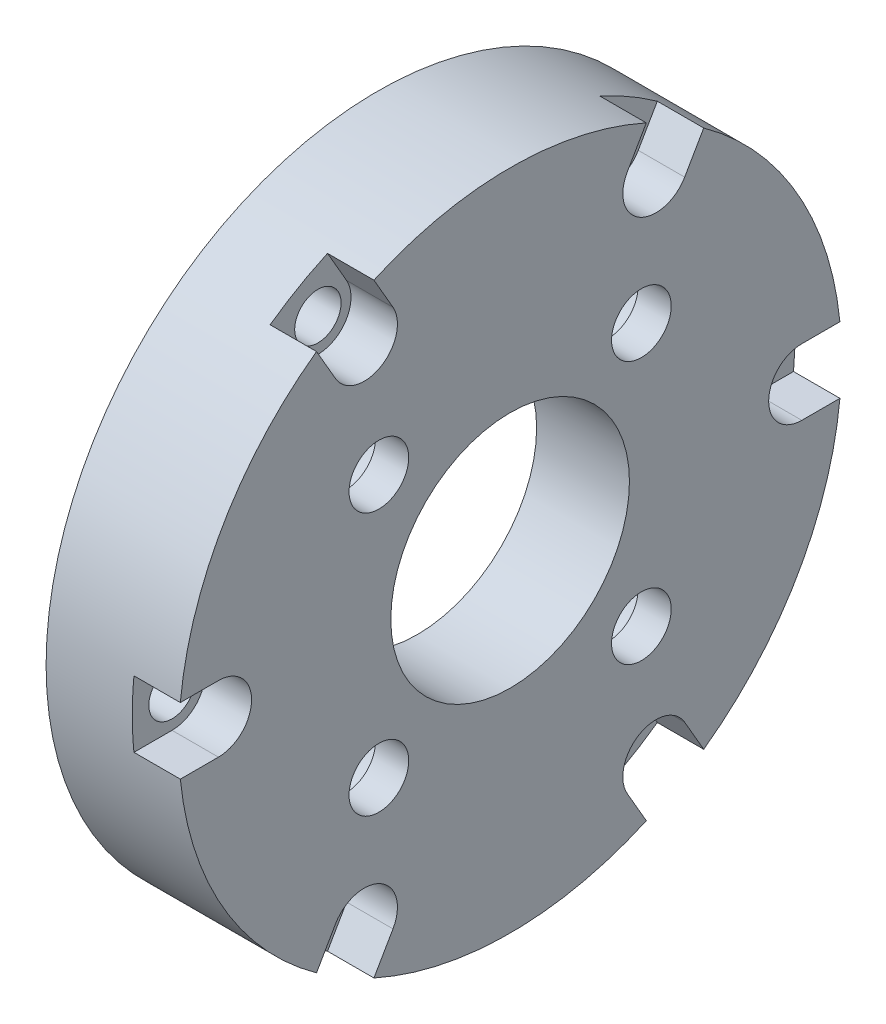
ISO-10303-21;
HEADER;
FILE_DESCRIPTION(('STEP AP214'),'2;1');
FILE_NAME('part.step','',(''),(''),'','','');
FILE_SCHEMA(('AUTOMOTIVE_DESIGN { 1 0 10303 214 1 1 1 1 }'));
ENDSEC;
DATA;
#1=APPLICATION_CONTEXT('core data for automotive mechanical design processes');
#2=APPLICATION_PROTOCOL_DEFINITION('international standard','automotive_design',2000,#1);
#3=PRODUCT_CONTEXT('',#1,'mechanical');
#4=PRODUCT('Part','Part','',(#3));
#5=PRODUCT_RELATED_PRODUCT_CATEGORY('part','',(#4));
#6=PRODUCT_DEFINITION_FORMATION('','',#4);
#7=PRODUCT_DEFINITION_CONTEXT('part definition',#1,'design');
#8=PRODUCT_DEFINITION('design','',#6,#7);
#9=PRODUCT_DEFINITION_SHAPE('','',#8);
#10=(LENGTH_UNIT() NAMED_UNIT(*) SI_UNIT(.MILLI.,.METRE.));
#11=(NAMED_UNIT(*) PLANE_ANGLE_UNIT() SI_UNIT($,.RADIAN.));
#12=(NAMED_UNIT(*) SI_UNIT($,.STERADIAN.) SOLID_ANGLE_UNIT());
#13=UNCERTAINTY_MEASURE_WITH_UNIT(LENGTH_MEASURE(1.E-05),#10,'distance_accuracy_value','');
#14=(GEOMETRIC_REPRESENTATION_CONTEXT(3) GLOBAL_UNCERTAINTY_ASSIGNED_CONTEXT((#13)) GLOBAL_UNIT_ASSIGNED_CONTEXT((#10,
#11,#12)) REPRESENTATION_CONTEXT('',''));
#15=CARTESIAN_POINT('',(0.,0.,0.));
#16=DIRECTION('',(0.,0.,1.));
#17=DIRECTION('',(1.,0.,0.));
#18=AXIS2_PLACEMENT_3D('',#15,#16,#17);
#19=CARTESIAN_POINT('',(-2.,19.,0.));
#20=DIRECTION('',(1.,0.,0.));
#21=DIRECTION('',(0.,0.,-1.));
#22=AXIS2_PLACEMENT_3D('',#19,#20,#21);
#23=PLANE('',#22);
#24=CARTESIAN_POINT('',(-2.,0.,0.));
#25=DIRECTION('',(-1.,0.,0.));
#26=DIRECTION('',(0.,0.,1.));
#27=AXIS2_PLACEMENT_3D('',#24,#25,#26);
#28=CIRCLE('',#27,19.);
#29=CARTESIAN_POINT('',(-2.,0.,19.));
#30=VERTEX_POINT('',#29);
#31=EDGE_CURVE('E359',#30,#30,#28,.T.);
#32=ORIENTED_EDGE('',*,*,#31,.T.);
#33=EDGE_LOOP('',(#32));
#34=FACE_BOUND('',#33,.T.);
#35=CARTESIAN_POINT('',(-2.,0.,0.));
#36=DIRECTION('',(-1.,0.,0.));
#37=DIRECTION('',(0.,0.,1.));
#38=AXIS2_PLACEMENT_3D('',#35,#36,#37);
#39=CIRCLE('',#38,8.99999999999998);
#40=CARTESIAN_POINT('',(-2.,0.,8.99999999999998));
#41=VERTEX_POINT('',#40);
#42=EDGE_CURVE('E356',#41,#41,#39,.T.);
#43=ORIENTED_EDGE('',*,*,#42,.F.);
#44=EDGE_LOOP('',(#43));
#45=FACE_BOUND('',#44,.T.);
#46=CARTESIAN_POINT('',(-2.,9.89949493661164,9.89949493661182));
#47=DIRECTION('',(-1.,0.,0.));
#48=DIRECTION('',(0.,0.,1.));
#49=AXIS2_PLACEMENT_3D('',#46,#47,#48);
#50=CIRCLE('',#49,3.99999999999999);
#51=CARTESIAN_POINT('',(-2.,9.89949493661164,13.8994949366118));
#52=VERTEX_POINT('',#51);
#53=EDGE_CURVE('E529',#52,#52,#50,.T.);
#54=ORIENTED_EDGE('',*,*,#53,.F.);
#55=EDGE_LOOP('',(#54));
#56=FACE_BOUND('',#55,.T.);
#57=CARTESIAN_POINT('',(-2.,-9.89949493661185,9.89949493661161));
#58=DIRECTION('',(-1.,0.,0.));
#59=DIRECTION('',(0.,0.,1.));
#60=AXIS2_PLACEMENT_3D('',#57,#58,#59);
#61=CIRCLE('',#60,3.99999999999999);
#62=CARTESIAN_POINT('',(-2.,-9.89949493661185,13.8994949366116));
#63=VERTEX_POINT('',#62);
#64=EDGE_CURVE('E541',#63,#63,#61,.T.);
#65=ORIENTED_EDGE('',*,*,#64,.F.);
#66=EDGE_LOOP('',(#65));
#67=FACE_BOUND('',#66,.T.);
#68=CARTESIAN_POINT('',(-2.,-9.89949493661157,-9.89949493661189));
#69=DIRECTION('',(-1.,0.,0.));
#70=DIRECTION('',(0.,0.,1.));
#71=AXIS2_PLACEMENT_3D('',#68,#69,#70);
#72=CIRCLE('',#71,3.99999999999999);
#73=CARTESIAN_POINT('',(-2.,-9.89949493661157,-5.89949493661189));
#74=VERTEX_POINT('',#73);
#75=EDGE_CURVE('E553',#74,#74,#72,.T.);
#76=ORIENTED_EDGE('',*,*,#75,.F.);
#77=EDGE_LOOP('',(#76));
#78=FACE_BOUND('',#77,.T.);
#79=CARTESIAN_POINT('',(-2.,9.89949493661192,-9.89949493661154));
#80=DIRECTION('',(-1.,0.,0.));
#81=DIRECTION('',(0.,0.,1.));
#82=AXIS2_PLACEMENT_3D('',#79,#80,#81);
#83=CIRCLE('',#82,3.99999999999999);
#84=CARTESIAN_POINT('',(-2.,9.89949493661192,-5.89949493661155));
#85=VERTEX_POINT('',#84);
#86=EDGE_CURVE('E565',#85,#85,#83,.T.);
#87=ORIENTED_EDGE('',*,*,#86,.F.);
#88=EDGE_LOOP('',(#87));
#89=FACE_BOUND('',#88,.T.);
#90=ADVANCED_FACE('F31',(#34,#45,#56,#67,#78,#89),#23,.F.);
#91=CARTESIAN_POINT('',(-14.9363733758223,0.,0.));
#92=DIRECTION('',(-1.,0.,0.));
#93=DIRECTION('',(0.,0.,1.));
#94=AXIS2_PLACEMENT_3D('',#91,#92,#93);
#95=CYLINDRICAL_SURFACE('',#94,25.);
#96=CARTESIAN_POINT('',(4.99999999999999,0.,0.));
#97=DIRECTION('',(-1.,0.,0.));
#98=DIRECTION('',(0.,0.,1.));
#99=AXIS2_PLACEMENT_3D('',#96,#97,#98);
#100=CIRCLE('',#99,25.);
#101=CARTESIAN_POINT('',(4.99999999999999,2.5,24.8746859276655));
#102=VERTEX_POINT('',#101);
#103=CARTESIAN_POINT('',(4.99999999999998,20.2921099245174,14.6024064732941));
#104=VERTEX_POINT('',#103);
#105=EDGE_CURVE('E350',#102,#104,#100,.T.);
#106=ORIENTED_EDGE('',*,*,#105,.T.);
#107=DIRECTION('',(-1.,0.,0.));
#108=VECTOR('',#107,1.);
#109=CARTESIAN_POINT('',(-14.9363733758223,20.2921099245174,14.6024064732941));
#110=LINE('',#109,#108);
#111=CARTESIAN_POINT('',(1.49999999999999,20.2921099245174,14.6024064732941));
#112=VERTEX_POINT('',#111);
#113=EDGE_CURVE('E198',#104,#112,#110,.T.);
#114=ORIENTED_EDGE('',*,*,#113,.T.);
#115=CARTESIAN_POINT('',(1.49999999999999,0.,0.));
#116=DIRECTION('',(1.,0.,0.));
#117=DIRECTION('',(0.,0.,-1.));
#118=AXIS2_PLACEMENT_3D('',#115,#116,#117);
#119=CIRCLE('',#118,25.);
#120=CARTESIAN_POINT('',(1.49999999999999,22.7921099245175,10.2722794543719));
#121=VERTEX_POINT('',#120);
#122=EDGE_CURVE('E11',#121,#112,#119,.T.);
#123=ORIENTED_EDGE('',*,*,#122,.F.);
#124=DIRECTION('',(-1.,0.,0.));
#125=VECTOR('',#124,1.);
#126=CARTESIAN_POINT('',(-14.9363733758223,22.7921099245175,10.2722794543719));
#127=LINE('',#126,#125);
#128=CARTESIAN_POINT('',(4.99999999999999,22.7921099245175,10.2722794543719));
#129=VERTEX_POINT('',#128);
#130=EDGE_CURVE('E206',#121,#129,#127,.F.);
#131=ORIENTED_EDGE('',*,*,#130,.T.);
#132=CARTESIAN_POINT('',(4.99999999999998,22.7921099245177,-10.2722794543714));
#133=VERTEX_POINT('',#132);
#134=EDGE_CURVE('E353',#129,#133,#100,.T.);
#135=ORIENTED_EDGE('',*,*,#134,.T.);
#136=DIRECTION('',(-1.,0.,0.));
#137=VECTOR('',#136,1.);
#138=CARTESIAN_POINT('',(-14.9363733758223,22.7921099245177,-10.2722794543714));
#139=LINE('',#138,#137);
#140=CARTESIAN_POINT('',(1.49999999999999,22.7921099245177,-10.2722794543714));
#141=VERTEX_POINT('',#140);
#142=EDGE_CURVE('E250',#133,#141,#139,.T.);
#143=ORIENTED_EDGE('',*,*,#142,.T.);
#144=CARTESIAN_POINT('',(1.49999999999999,0.,0.));
#145=DIRECTION('',(1.,0.,0.));
#146=DIRECTION('',(0.,0.,-1.));
#147=AXIS2_PLACEMENT_3D('',#144,#145,#146);
#148=CIRCLE('',#147,25.);
#149=CARTESIAN_POINT('',(1.49999999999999,20.2921099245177,-14.6024064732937));
#150=VERTEX_POINT('',#149);
#151=EDGE_CURVE('E202',#150,#141,#148,.T.);
#152=ORIENTED_EDGE('',*,*,#151,.F.);
#153=DIRECTION('',(-1.,0.,0.));
#154=VECTOR('',#153,1.);
#155=CARTESIAN_POINT('',(-14.9363733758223,20.2921099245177,-14.6024064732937));
#156=LINE('',#155,#154);
#157=CARTESIAN_POINT('',(4.99999999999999,20.2921099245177,-14.6024064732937));
#158=VERTEX_POINT('',#157);
#159=EDGE_CURVE('E246',#150,#158,#156,.F.);
#160=ORIENTED_EDGE('',*,*,#159,.T.);
#161=CARTESIAN_POINT('',(4.99999999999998,2.50000000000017,-24.8746859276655));
#162=VERTEX_POINT('',#161);
#163=EDGE_CURVE('E404',#158,#162,#100,.T.);
#164=ORIENTED_EDGE('',*,*,#163,.T.);
#165=DIRECTION('',(-1.,0.,0.));
#166=VECTOR('',#165,1.);
#167=CARTESIAN_POINT('',(-14.9363733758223,2.50000000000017,-24.8746859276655));
#168=LINE('',#167,#166);
#169=CARTESIAN_POINT('',(1.49999999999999,2.50000000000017,-24.8746859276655));
#170=VERTEX_POINT('',#169);
#171=EDGE_CURVE('E274',#162,#170,#168,.T.);
#172=ORIENTED_EDGE('',*,*,#171,.T.);
#173=CARTESIAN_POINT('',(1.49999999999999,0.,0.));
#174=DIRECTION('',(1.,0.,0.));
#175=DIRECTION('',(0.,1.,0.));
#176=AXIS2_PLACEMENT_3D('',#173,#174,#175);
#177=CIRCLE('',#176,25.);
#178=CARTESIAN_POINT('',(1.49999999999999,-2.49999999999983,-24.8746859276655));
#179=VERTEX_POINT('',#178);
#180=EDGE_CURVE('E386',#179,#170,#177,.T.);
#181=ORIENTED_EDGE('',*,*,#180,.F.);
#182=DIRECTION('',(-1.,0.,0.));
#183=VECTOR('',#182,1.);
#184=CARTESIAN_POINT('',(-14.9363733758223,-2.49999999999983,-24.8746859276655));
#185=LINE('',#184,#183);
#186=CARTESIAN_POINT('',(4.99999999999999,-2.49999999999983,-24.8746859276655));
#187=VERTEX_POINT('',#186);
#188=EDGE_CURVE('E269',#179,#187,#185,.F.);
#189=ORIENTED_EDGE('',*,*,#188,.T.);
#190=CARTESIAN_POINT('',(4.99999999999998,-20.2921099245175,-14.6024064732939));
#191=VERTEX_POINT('',#190);
#192=EDGE_CURVE('E405',#187,#191,#100,.T.);
#193=ORIENTED_EDGE('',*,*,#192,.T.);
#194=DIRECTION('',(-1.,0.,0.));
#195=VECTOR('',#194,1.);
#196=CARTESIAN_POINT('',(-14.9363733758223,-20.2921099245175,-14.6024064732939));
#197=LINE('',#196,#195);
#198=CARTESIAN_POINT('',(1.49999999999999,-20.2921099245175,-14.6024064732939));
#199=VERTEX_POINT('',#198);
#200=EDGE_CURVE('E298',#191,#199,#197,.T.);
#201=ORIENTED_EDGE('',*,*,#200,.T.);
#202=CARTESIAN_POINT('',(1.49999999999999,0.,0.));
#203=DIRECTION('',(1.,0.,0.));
#204=DIRECTION('',(0.,0.,-1.));
#205=AXIS2_PLACEMENT_3D('',#202,#203,#204);
#206=CIRCLE('',#205,25.);
#207=CARTESIAN_POINT('',(1.49999999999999,-22.7921099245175,-10.2722794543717));
#208=VERTEX_POINT('',#207);
#209=EDGE_CURVE('E381',#208,#199,#206,.T.);
#210=ORIENTED_EDGE('',*,*,#209,.F.);
#211=DIRECTION('',(-1.,0.,0.));
#212=VECTOR('',#211,1.);
#213=CARTESIAN_POINT('',(-14.9363733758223,-22.7921099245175,-10.2722794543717));
#214=LINE('',#213,#212);
#215=CARTESIAN_POINT('',(4.99999999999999,-22.7921099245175,-10.2722794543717));
#216=VERTEX_POINT('',#215);
#217=EDGE_CURVE('E293',#208,#216,#214,.F.);
#218=ORIENTED_EDGE('',*,*,#217,.T.);
#219=CARTESIAN_POINT('',(4.99999999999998,-22.7921099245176,10.2722794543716));
#220=VERTEX_POINT('',#219);
#221=EDGE_CURVE('E408',#216,#220,#100,.T.);
#222=ORIENTED_EDGE('',*,*,#221,.T.);
#223=DIRECTION('',(-1.,0.,0.));
#224=VECTOR('',#223,1.);
#225=CARTESIAN_POINT('',(-14.9363733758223,-22.7921099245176,10.2722794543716));
#226=LINE('',#225,#224);
#227=CARTESIAN_POINT('',(1.49999999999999,-22.7921099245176,10.2722794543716));
#228=VERTEX_POINT('',#227);
#229=EDGE_CURVE('E322',#220,#228,#226,.T.);
#230=ORIENTED_EDGE('',*,*,#229,.T.);
#231=CARTESIAN_POINT('',(1.49999999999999,0.,0.));
#232=DIRECTION('',(1.,0.,0.));
#233=DIRECTION('',(0.,0.,-1.));
#234=AXIS2_PLACEMENT_3D('',#231,#232,#233);
#235=CIRCLE('',#234,25.);
#236=CARTESIAN_POINT('',(1.49999999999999,-20.2921099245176,14.6024064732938));
#237=VERTEX_POINT('',#236);
#238=EDGE_CURVE('E376',#237,#228,#235,.T.);
#239=ORIENTED_EDGE('',*,*,#238,.F.);
#240=DIRECTION('',(-1.,0.,0.));
#241=VECTOR('',#240,1.);
#242=CARTESIAN_POINT('',(-14.9363733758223,-20.2921099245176,14.6024064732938));
#243=LINE('',#242,#241);
#244=CARTESIAN_POINT('',(4.99999999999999,-20.2921099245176,14.6024064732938));
#245=VERTEX_POINT('',#244);
#246=EDGE_CURVE('E317',#237,#245,#243,.F.);
#247=ORIENTED_EDGE('',*,*,#246,.T.);
#248=CARTESIAN_POINT('',(4.99999999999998,-2.5,24.8746859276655));
#249=VERTEX_POINT('',#248);
#250=EDGE_CURVE('E349',#245,#249,#100,.T.);
#251=ORIENTED_EDGE('',*,*,#250,.T.);
#252=DIRECTION('',(-1.,0.,0.));
#253=VECTOR('',#252,1.);
#254=CARTESIAN_POINT('',(-14.9363733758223,-2.49999999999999,24.8746859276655));
#255=LINE('',#254,#253);
#256=CARTESIAN_POINT('',(1.49999999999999,-2.5,24.8746859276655));
#257=VERTEX_POINT('',#256);
#258=EDGE_CURVE('E346',#249,#257,#255,.T.);
#259=ORIENTED_EDGE('',*,*,#258,.T.);
#260=CARTESIAN_POINT('',(1.49999999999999,0.,0.));
#261=DIRECTION('',(1.,0.,0.));
#262=DIRECTION('',(0.,1.,0.));
#263=AXIS2_PLACEMENT_3D('',#260,#261,#262);
#264=CIRCLE('',#263,25.);
#265=CARTESIAN_POINT('',(1.49999999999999,2.5,24.8746859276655));
#266=VERTEX_POINT('',#265);
#267=EDGE_CURVE('E371',#266,#257,#264,.T.);
#268=ORIENTED_EDGE('',*,*,#267,.F.);
#269=DIRECTION('',(-1.,0.,0.));
#270=VECTOR('',#269,1.);
#271=CARTESIAN_POINT('',(-14.9363733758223,2.50000000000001,24.8746859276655));
#272=LINE('',#271,#270);
#273=EDGE_CURVE('E341',#266,#102,#272,.F.);
#274=ORIENTED_EDGE('',*,*,#273,.T.);
#275=EDGE_LOOP('',(#106,#114,#123,#131,#135,#143,#152,#160,#164,#172,#181,#189,#193,#201,#210,
#218,#222,#230,#239,#247,#251,#259,#268,#274));
#276=FACE_BOUND('',#275,.T.);
#277=CARTESIAN_POINT('',(-5.,0.,0.));
#278=DIRECTION('',(-1.,0.,0.));
#279=DIRECTION('',(0.,0.,1.));
#280=AXIS2_PLACEMENT_3D('',#277,#278,#279);
#281=CIRCLE('',#280,25.);
#282=CARTESIAN_POINT('',(-5.,0.,25.));
#283=VERTEX_POINT('',#282);
#284=EDGE_CURVE('E365',#283,#283,#281,.T.);
#285=ORIENTED_EDGE('',*,*,#284,.F.);
#286=EDGE_LOOP('',(#285));
#287=FACE_BOUND('',#286,.T.);
#288=ADVANCED_FACE('F33',(#276,#287),#95,.T.);
#289=CARTESIAN_POINT('',(-5.,25.,0.));
#290=DIRECTION('',(1.,0.,0.));
#291=DIRECTION('',(0.,0.,-1.));
#292=AXIS2_PLACEMENT_3D('',#289,#290,#291);
#293=PLANE('',#292);
#294=CARTESIAN_POINT('',(-5.00000000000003,19.0525588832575,11.0000000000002));
#295=DIRECTION('',(1.,0.,0.));
#296=DIRECTION('',(0.,-0.866025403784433,-0.50000000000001));
#297=AXIS2_PLACEMENT_3D('',#294,#295,#296);
#298=CIRCLE('',#297,1.75);
#299=CARTESIAN_POINT('',(-5.00000000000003,17.5370144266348,10.1250000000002));
#300=VERTEX_POINT('',#299);
#301=EDGE_CURVE('E468',#300,#300,#298,.T.);
#302=ORIENTED_EDGE('',*,*,#301,.T.);
#303=EDGE_LOOP('',(#302));
#304=FACE_BOUND('',#303,.T.);
#305=CARTESIAN_POINT('',(-5.00000000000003,19.0525588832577,-10.9999999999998));
#306=DIRECTION('',(1.,0.,0.));
#307=DIRECTION('',(0.,-0.866025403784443,0.499999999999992));
#308=AXIS2_PLACEMENT_3D('',#305,#306,#307);
#309=CIRCLE('',#308,1.75);
#310=CARTESIAN_POINT('',(-5.00000000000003,17.537014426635,-10.1249999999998));
#311=VERTEX_POINT('',#310);
#312=EDGE_CURVE('E472',#311,#311,#309,.T.);
#313=ORIENTED_EDGE('',*,*,#312,.T.);
#314=EDGE_LOOP('',(#313));
#315=FACE_BOUND('',#314,.T.);
#316=CARTESIAN_POINT('',(-5.00000000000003,1.53153456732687E-13,-22.));
#317=DIRECTION('',(1.,0.,0.));
#318=DIRECTION('',(0.,0.,1.));
#319=AXIS2_PLACEMENT_3D('',#316,#317,#318);
#320=CIRCLE('',#319,1.75);
#321=CARTESIAN_POINT('',(-5.00000000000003,1.40933264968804E-13,-20.25));
#322=VERTEX_POINT('',#321);
#323=EDGE_CURVE('E476',#322,#322,#320,.T.);
#324=ORIENTED_EDGE('',*,*,#323,.T.);
#325=EDGE_LOOP('',(#324));
#326=FACE_BOUND('',#325,.T.);
#327=CARTESIAN_POINT('',(-5.00000000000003,-19.0525588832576,-11.0000000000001));
#328=DIRECTION('',(1.,0.,0.));
#329=DIRECTION('',(0.,0.866025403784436,0.500000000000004));
#330=AXIS2_PLACEMENT_3D('',#327,#328,#329);
#331=CIRCLE('',#330,1.75);
#332=CARTESIAN_POINT('',(-5.00000000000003,-17.5370144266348,-10.1250000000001));
#333=VERTEX_POINT('',#332);
#334=EDGE_CURVE('E480',#333,#333,#331,.T.);
#335=ORIENTED_EDGE('',*,*,#334,.T.);
#336=EDGE_LOOP('',(#335));
#337=FACE_BOUND('',#336,.T.);
#338=CARTESIAN_POINT('',(-5.00000000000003,-19.0525588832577,11.));
#339=DIRECTION('',(1.,0.,0.));
#340=DIRECTION('',(0.,0.86602540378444,-0.499999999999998));
#341=AXIS2_PLACEMENT_3D('',#338,#339,#340);
#342=CIRCLE('',#341,1.75);
#343=CARTESIAN_POINT('',(-5.00000000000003,-17.5370144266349,10.125));
#344=VERTEX_POINT('',#343);
#345=EDGE_CURVE('E484',#344,#344,#342,.T.);
#346=ORIENTED_EDGE('',*,*,#345,.T.);
#347=EDGE_LOOP('',(#346));
#348=FACE_BOUND('',#347,.T.);
#349=CARTESIAN_POINT('',(-5.00000000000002,0.,22.));
#350=DIRECTION('',(1.,0.,0.));
#351=DIRECTION('',(0.,0.,-1.));
#352=AXIS2_PLACEMENT_3D('',#349,#350,#351);
#353=CIRCLE('',#352,1.75);
#354=CARTESIAN_POINT('',(-5.00000000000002,0.,20.25));
#355=VERTEX_POINT('',#354);
#356=EDGE_CURVE('E214',#355,#355,#353,.T.);
#357=ORIENTED_EDGE('',*,*,#356,.T.);
#358=EDGE_LOOP('',(#357));
#359=FACE_BOUND('',#358,.T.);
#360=CARTESIAN_POINT('',(-5.,0.,0.));
#361=DIRECTION('',(-1.,0.,0.));
#362=DIRECTION('',(0.,0.,1.));
#363=AXIS2_PLACEMENT_3D('',#360,#361,#362);
#364=CIRCLE('',#363,19.);
#365=CARTESIAN_POINT('',(-5.,0.,19.));
#366=VERTEX_POINT('',#365);
#367=EDGE_CURVE('E362',#366,#366,#364,.T.);
#368=ORIENTED_EDGE('',*,*,#367,.F.);
#369=EDGE_LOOP('',(#368));
#370=FACE_BOUND('',#369,.T.);
#371=ORIENTED_EDGE('',*,*,#284,.T.);
#372=EDGE_LOOP('',(#371));
#373=FACE_BOUND('',#372,.T.);
#374=ADVANCED_FACE('F452',(#304,#315,#326,#337,#348,#359,#370,#373),#293,.F.);
#375=CARTESIAN_POINT('',(-14.9363733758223,0.,0.));
#376=DIRECTION('',(-1.,0.,0.));
#377=DIRECTION('',(0.,0.,1.));
#378=AXIS2_PLACEMENT_3D('',#375,#376,#377);
#379=CYLINDRICAL_SURFACE('',#378,19.);
#380=ORIENTED_EDGE('',*,*,#31,.F.);
#381=EDGE_LOOP('',(#380));
#382=FACE_BOUND('',#381,.T.);
#383=ORIENTED_EDGE('',*,*,#367,.T.);
#384=EDGE_LOOP('',(#383));
#385=FACE_BOUND('',#384,.T.);
#386=ADVANCED_FACE('F458',(#382,#385),#379,.F.);
#387=CARTESIAN_POINT('',(-14.9363733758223,0.,0.));
#388=DIRECTION('',(-1.,0.,0.));
#389=DIRECTION('',(0.,0.,1.));
#390=AXIS2_PLACEMENT_3D('',#387,#388,#389);
#391=CYLINDRICAL_SURFACE('',#390,8.99999999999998);
#392=CARTESIAN_POINT('',(4.99999999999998,0.,0.));
#393=DIRECTION('',(-1.,0.,0.));
#394=DIRECTION('',(0.,0.,1.));
#395=AXIS2_PLACEMENT_3D('',#392,#393,#394);
#396=CIRCLE('',#395,8.99999999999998);
#397=CARTESIAN_POINT('',(4.99999999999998,0.,8.99999999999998));
#398=VERTEX_POINT('',#397);
#399=EDGE_CURVE('E352',#398,#398,#396,.T.);
#400=ORIENTED_EDGE('',*,*,#399,.F.);
#401=EDGE_LOOP('',(#400));
#402=FACE_BOUND('',#401,.T.);
#403=ORIENTED_EDGE('',*,*,#42,.T.);
#404=EDGE_LOOP('',(#403));
#405=FACE_BOUND('',#404,.T.);
#406=ADVANCED_FACE('F456',(#402,#405),#391,.F.);
#407=CARTESIAN_POINT('',(4.99999999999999,9.,0.));
#408=DIRECTION('',(-1.,0.,0.));
#409=DIRECTION('',(0.,0.,1.));
#410=AXIS2_PLACEMENT_3D('',#407,#408,#409);
#411=PLANE('',#410);
#412=CARTESIAN_POINT('',(4.99999999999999,9.89949493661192,-9.89949493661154));
#413=DIRECTION('',(-1.,0.,0.));
#414=DIRECTION('',(0.,0.,1.));
#415=AXIS2_PLACEMENT_3D('',#412,#413,#414);
#416=CIRCLE('',#415,2.25);
#417=CARTESIAN_POINT('',(4.99999999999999,9.89949493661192,-7.64949493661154));
#418=VERTEX_POINT('',#417);
#419=EDGE_CURVE('E556',#418,#418,#416,.T.);
#420=ORIENTED_EDGE('',*,*,#419,.T.);
#421=EDGE_LOOP('',(#420));
#422=FACE_BOUND('',#421,.T.);
#423=CARTESIAN_POINT('',(4.99999999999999,-9.89949493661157,-9.89949493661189));
#424=DIRECTION('',(-1.,0.,0.));
#425=DIRECTION('',(0.,0.,1.));
#426=AXIS2_PLACEMENT_3D('',#423,#424,#425);
#427=CIRCLE('',#426,2.25);
#428=CARTESIAN_POINT('',(4.99999999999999,-9.89949493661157,-7.64949493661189));
#429=VERTEX_POINT('',#428);
#430=EDGE_CURVE('E544',#429,#429,#427,.T.);
#431=ORIENTED_EDGE('',*,*,#430,.T.);
#432=EDGE_LOOP('',(#431));
#433=FACE_BOUND('',#432,.T.);
#434=CARTESIAN_POINT('',(4.99999999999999,-9.89949493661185,9.89949493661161));
#435=DIRECTION('',(-1.,0.,0.));
#436=DIRECTION('',(0.,0.,1.));
#437=AXIS2_PLACEMENT_3D('',#434,#435,#436);
#438=CIRCLE('',#437,2.25);
#439=CARTESIAN_POINT('',(4.99999999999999,-9.89949493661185,12.1494949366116));
#440=VERTEX_POINT('',#439);
#441=EDGE_CURVE('E532',#440,#440,#438,.T.);
#442=ORIENTED_EDGE('',*,*,#441,.T.);
#443=EDGE_LOOP('',(#442));
#444=FACE_BOUND('',#443,.T.);
#445=CARTESIAN_POINT('',(4.99999999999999,9.89949493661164,9.89949493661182));
#446=DIRECTION('',(-1.,0.,0.));
#447=DIRECTION('',(0.,0.,1.));
#448=AXIS2_PLACEMENT_3D('',#445,#446,#447);
#449=CIRCLE('',#448,2.25);
#450=CARTESIAN_POINT('',(4.99999999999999,9.89949493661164,12.1494949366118));
#451=VERTEX_POINT('',#450);
#452=EDGE_CURVE('E520',#451,#451,#449,.T.);
#453=ORIENTED_EDGE('',*,*,#452,.T.);
#454=EDGE_LOOP('',(#453));
#455=FACE_BOUND('',#454,.T.);
#456=CARTESIAN_POINT('',(4.99999999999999,19.0525588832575,11.0000000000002));
#457=DIRECTION('',(1.,0.,0.));
#458=DIRECTION('',(0.,0.50000000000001,-0.866025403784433));
#459=AXIS2_PLACEMENT_3D('',#456,#457,#458);
#460=CIRCLE('',#459,2.5);
#461=CARTESIAN_POINT('',(4.99999999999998,17.8025588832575,13.1650635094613));
#462=VERTEX_POINT('',#461);
#463=CARTESIAN_POINT('',(4.99999999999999,20.3025588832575,8.83493649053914));
#464=VERTEX_POINT('',#463);
#465=EDGE_CURVE('E46',#462,#464,#460,.T.);
#466=ORIENTED_EDGE('',*,*,#465,.F.);
#467=DIRECTION('',(0.,0.866025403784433,0.50000000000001));
#468=VECTOR('',#467,1.);
#469=CARTESIAN_POINT('',(4.99999999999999,5.49999999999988,6.0621778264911));
#470=LINE('',#469,#468);
#471=EDGE_CURVE('E39',#462,#104,#470,.T.);
#472=ORIENTED_EDGE('',*,*,#471,.T.);
#473=ORIENTED_EDGE('',*,*,#105,.F.);
#474=DIRECTION('',(0.,0.,1.));
#475=VECTOR('',#474,1.);
#476=CARTESIAN_POINT('',(4.99999999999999,2.5,22.));
#477=LINE('',#476,#475);
#478=CARTESIAN_POINT('',(4.99999999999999,2.5,22.));
#479=VERTEX_POINT('',#478);
#480=EDGE_CURVE('E327',#479,#102,#477,.T.);
#481=ORIENTED_EDGE('',*,*,#480,.F.);
#482=CARTESIAN_POINT('',(4.99999999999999,0.,22.));
#483=DIRECTION('',(1.,0.,0.));
#484=DIRECTION('',(0.,1.,0.));
#485=AXIS2_PLACEMENT_3D('',#482,#483,#484);
#486=CIRCLE('',#485,2.5);
#487=CARTESIAN_POINT('',(4.99999999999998,-2.5,22.));
#488=VERTEX_POINT('',#487);
#489=EDGE_CURVE('E325',#488,#479,#486,.T.);
#490=ORIENTED_EDGE('',*,*,#489,.F.);
#491=DIRECTION('',(0.,0.,1.));
#492=VECTOR('',#491,1.);
#493=CARTESIAN_POINT('',(4.99999999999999,-2.49999999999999,0.));
#494=LINE('',#493,#492);
#495=EDGE_CURVE('E368',#488,#249,#494,.T.);
#496=ORIENTED_EDGE('',*,*,#495,.T.);
#497=ORIENTED_EDGE('',*,*,#250,.F.);
#498=DIRECTION('',(0.,-0.86602540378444,0.499999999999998));
#499=VECTOR('',#498,1.);
#500=CARTESIAN_POINT('',(4.99999999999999,-17.8025588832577,13.1650635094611));
#501=LINE('',#500,#499);
#502=CARTESIAN_POINT('',(4.99999999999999,-17.8025588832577,13.1650635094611));
#503=VERTEX_POINT('',#502);
#504=EDGE_CURVE('E303',#503,#245,#501,.T.);
#505=ORIENTED_EDGE('',*,*,#504,.F.);
#506=CARTESIAN_POINT('',(4.99999999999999,-19.0525588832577,11.));
#507=DIRECTION('',(1.,0.,0.));
#508=DIRECTION('',(0.,0.499999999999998,0.86602540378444));
#509=AXIS2_PLACEMENT_3D('',#506,#507,#508);
#510=CIRCLE('',#509,2.5);
#511=CARTESIAN_POINT('',(4.99999999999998,-20.3025588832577,8.83493649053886));
#512=VERTEX_POINT('',#511);
#513=EDGE_CURVE('E301',#512,#503,#510,.T.);
#514=ORIENTED_EDGE('',*,*,#513,.F.);
#515=DIRECTION('',(0.,-0.86602540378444,0.499999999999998));
#516=VECTOR('',#515,1.);
#517=CARTESIAN_POINT('',(4.99999999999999,5.50000000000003,-6.06217782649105));
#518=LINE('',#517,#516);
#519=EDGE_CURVE('E373',#512,#220,#518,.T.);
#520=ORIENTED_EDGE('',*,*,#519,.T.);
#521=ORIENTED_EDGE('',*,*,#221,.F.);
#522=DIRECTION('',(0.,-0.866025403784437,-0.500000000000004));
#523=VECTOR('',#522,1.);
#524=CARTESIAN_POINT('',(4.99999999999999,-20.3025588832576,-8.834936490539));
#525=LINE('',#524,#523);
#526=CARTESIAN_POINT('',(4.99999999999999,-20.3025588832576,-8.834936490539));
#527=VERTEX_POINT('',#526);
#528=EDGE_CURVE('E279',#527,#216,#525,.T.);
#529=ORIENTED_EDGE('',*,*,#528,.F.);
#530=CARTESIAN_POINT('',(4.99999999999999,-19.0525588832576,-11.0000000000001));
#531=DIRECTION('',(1.,0.,0.));
#532=DIRECTION('',(0.,-0.500000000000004,0.866025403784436));
#533=AXIS2_PLACEMENT_3D('',#530,#531,#532);
#534=CIRCLE('',#533,2.5);
#535=CARTESIAN_POINT('',(4.99999999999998,-17.8025588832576,-13.1650635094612));
#536=VERTEX_POINT('',#535);
#537=EDGE_CURVE('E277',#536,#527,#534,.T.);
#538=ORIENTED_EDGE('',*,*,#537,.F.);
#539=DIRECTION('',(0.,-0.866025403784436,-0.500000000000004));
#540=VECTOR('',#539,1.);
#541=CARTESIAN_POINT('',(4.99999999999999,7.99999999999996,1.73205080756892));
#542=LINE('',#541,#540);
#543=EDGE_CURVE('E378',#536,#191,#542,.T.);
#544=ORIENTED_EDGE('',*,*,#543,.T.);
#545=ORIENTED_EDGE('',*,*,#192,.F.);
#546=DIRECTION('',(0.,0.,-1.));
#547=VECTOR('',#546,1.);
#548=CARTESIAN_POINT('',(4.99999999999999,-2.49999999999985,-22.));
#549=LINE('',#548,#547);
#550=CARTESIAN_POINT('',(4.99999999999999,-2.49999999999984,-22.));
#551=VERTEX_POINT('',#550);
#552=EDGE_CURVE('E255',#551,#187,#549,.T.);
#553=ORIENTED_EDGE('',*,*,#552,.F.);
#554=CARTESIAN_POINT('',(4.99999999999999,1.53625267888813E-13,-22.));
#555=DIRECTION('',(1.,0.,0.));
#556=DIRECTION('',(0.,-1.,0.));
#557=AXIS2_PLACEMENT_3D('',#554,#555,#556);
#558=CIRCLE('',#557,2.5);
#559=CARTESIAN_POINT('',(4.99999999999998,2.50000000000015,-22.));
#560=VERTEX_POINT('',#559);
#561=EDGE_CURVE('E253',#560,#551,#558,.T.);
#562=ORIENTED_EDGE('',*,*,#561,.F.);
#563=DIRECTION('',(0.,0.,-1.));
#564=VECTOR('',#563,1.);
#565=CARTESIAN_POINT('',(4.99999999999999,2.49999999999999,0.));
#566=LINE('',#565,#564);
#567=EDGE_CURVE('E383',#560,#162,#566,.T.);
#568=ORIENTED_EDGE('',*,*,#567,.T.);
#569=ORIENTED_EDGE('',*,*,#163,.F.);
#570=DIRECTION('',(0.,0.866025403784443,-0.499999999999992));
#571=VECTOR('',#570,1.);
#572=CARTESIAN_POINT('',(4.99999999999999,17.8025588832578,-13.1650635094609));
#573=LINE('',#572,#571);
#574=CARTESIAN_POINT('',(4.99999999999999,17.8025588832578,-13.1650635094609));
#575=VERTEX_POINT('',#574);
#576=EDGE_CURVE('E233',#575,#158,#573,.T.);
#577=ORIENTED_EDGE('',*,*,#576,.F.);
#578=CARTESIAN_POINT('',(4.99999999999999,19.0525588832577,-10.9999999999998));
#579=DIRECTION('',(1.,0.,0.));
#580=DIRECTION('',(0.,-0.499999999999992,-0.866025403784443));
#581=AXIS2_PLACEMENT_3D('',#578,#579,#580);
#582=CIRCLE('',#581,2.5);
#583=CARTESIAN_POINT('',(4.99999999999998,20.3025588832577,-8.83493649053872));
#584=VERTEX_POINT('',#583);
#585=EDGE_CURVE('E54',#584,#575,#582,.T.);
#586=ORIENTED_EDGE('',*,*,#585,.F.);
#587=DIRECTION('',(0.,0.866025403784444,-0.499999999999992));
#588=VECTOR('',#587,1.);
#589=CARTESIAN_POINT('',(4.99999999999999,8.00000000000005,-1.73205080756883));
#590=LINE('',#589,#588);
#591=EDGE_CURVE('E388',#584,#133,#590,.T.);
#592=ORIENTED_EDGE('',*,*,#591,.T.);
#593=ORIENTED_EDGE('',*,*,#134,.F.);
#594=DIRECTION('',(0.,0.866025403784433,0.50000000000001));
#595=VECTOR('',#594,1.);
#596=CARTESIAN_POINT('',(4.99999999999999,20.3025588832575,8.83493649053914));
#597=LINE('',#596,#595);
#598=EDGE_CURVE('E213',#464,#129,#597,.T.);
#599=ORIENTED_EDGE('',*,*,#598,.F.);
#600=EDGE_LOOP('',(#466,#472,#473,#481,#490,#496,#497,#505,#514,#520,#521,#529,#538,#544,#545,
#553,#562,#568,#569,#577,#586,#592,#593,#599));
#601=FACE_BOUND('',#600,.T.);
#602=ORIENTED_EDGE('',*,*,#399,.T.);
#603=EDGE_LOOP('',(#602));
#604=FACE_BOUND('',#603,.T.);
#605=ADVANCED_FACE('F210',(#422,#433,#444,#455,#601,#604),#411,.F.);
#606=CARTESIAN_POINT('',(1.49999999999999,0.,22.));
#607=DIRECTION('',(1.,0.,0.));
#608=DIRECTION('',(0.,1.,0.));
#609=AXIS2_PLACEMENT_3D('',#606,#607,#608);
#610=PLANE('',#609);
#611=CARTESIAN_POINT('',(1.49999999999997,0.,22.));
#612=DIRECTION('',(1.,0.,0.));
#613=DIRECTION('',(0.,0.,-1.));
#614=AXIS2_PLACEMENT_3D('',#611,#612,#613);
#615=CIRCLE('',#614,1.75);
#616=CARTESIAN_POINT('',(1.49999999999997,0.,20.25));
#617=VERTEX_POINT('',#616);
#618=EDGE_CURVE('E218',#617,#617,#615,.T.);
#619=ORIENTED_EDGE('',*,*,#618,.F.);
#620=EDGE_LOOP('',(#619));
#621=FACE_BOUND('',#620,.T.);
#622=ORIENTED_EDGE('',*,*,#267,.T.);
#623=DIRECTION('',(0.,0.,-1.));
#624=VECTOR('',#623,1.);
#625=CARTESIAN_POINT('',(1.49999999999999,-2.5,22.));
#626=LINE('',#625,#624);
#627=CARTESIAN_POINT('',(1.49999999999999,-2.5,22.));
#628=VERTEX_POINT('',#627);
#629=EDGE_CURVE('E335',#257,#628,#626,.T.);
#630=ORIENTED_EDGE('',*,*,#629,.T.);
#631=CARTESIAN_POINT('',(1.49999999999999,0.,22.));
#632=DIRECTION('',(1.,0.,0.));
#633=DIRECTION('',(0.,1.,0.));
#634=AXIS2_PLACEMENT_3D('',#631,#632,#633);
#635=CIRCLE('',#634,2.5);
#636=CARTESIAN_POINT('',(1.49999999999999,2.5,22.));
#637=VERTEX_POINT('',#636);
#638=EDGE_CURVE('E329',#628,#637,#635,.T.);
#639=ORIENTED_EDGE('',*,*,#638,.T.);
#640=DIRECTION('',(0.,0.,1.));
#641=VECTOR('',#640,1.);
#642=CARTESIAN_POINT('',(1.49999999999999,2.5,22.));
#643=LINE('',#642,#641);
#644=EDGE_CURVE('E332',#637,#266,#643,.T.);
#645=ORIENTED_EDGE('',*,*,#644,.T.);
#646=EDGE_LOOP('',(#622,#630,#639,#645));
#647=FACE_BOUND('',#646,.T.);
#648=ADVANCED_FACE('F431',(#621,#647),#610,.T.);
#649=CARTESIAN_POINT('',(1.49999999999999,-2.5,22.));
#650=DIRECTION('',(0.,-1.,0.));
#651=DIRECTION('',(0.,0.,-1.));
#652=AXIS2_PLACEMENT_3D('',#649,#650,#651);
#653=PLANE('',#652);
#654=ORIENTED_EDGE('',*,*,#495,.F.);
#655=DIRECTION('',(1.,0.,0.));
#656=VECTOR('',#655,1.);
#657=CARTESIAN_POINT('',(1.49999999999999,-2.5,22.));
#658=LINE('',#657,#656);
#659=EDGE_CURVE('E338',#628,#488,#658,.T.);
#660=ORIENTED_EDGE('',*,*,#659,.F.);
#661=ORIENTED_EDGE('',*,*,#629,.F.);
#662=ORIENTED_EDGE('',*,*,#258,.F.);
#663=EDGE_LOOP('',(#654,#660,#661,#662));
#664=FACE_BOUND('',#663,.T.);
#665=ADVANCED_FACE('F420',(#664),#653,.F.);
#666=CARTESIAN_POINT('',(1.49999999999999,2.5,22.));
#667=DIRECTION('',(0.,1.,0.));
#668=DIRECTION('',(-1.,0.,0.));
#669=AXIS2_PLACEMENT_3D('',#666,#667,#668);
#670=PLANE('',#669);
#671=ORIENTED_EDGE('',*,*,#644,.F.);
#672=DIRECTION('',(1.,0.,0.));
#673=VECTOR('',#672,1.);
#674=CARTESIAN_POINT('',(1.49999999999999,2.5,22.));
#675=LINE('',#674,#673);
#676=EDGE_CURVE('E337',#637,#479,#675,.T.);
#677=ORIENTED_EDGE('',*,*,#676,.T.);
#678=ORIENTED_EDGE('',*,*,#480,.T.);
#679=ORIENTED_EDGE('',*,*,#273,.F.);
#680=EDGE_LOOP('',(#671,#677,#678,#679));
#681=FACE_BOUND('',#680,.T.);
#682=ADVANCED_FACE('F429',(#681),#670,.F.);
#683=CARTESIAN_POINT('',(1.49999999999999,0.,22.));
#684=DIRECTION('',(1.,0.,0.));
#685=DIRECTION('',(0.,1.,0.));
#686=AXIS2_PLACEMENT_3D('',#683,#684,#685);
#687=CYLINDRICAL_SURFACE('',#686,2.5);
#688=ORIENTED_EDGE('',*,*,#489,.T.);
#689=ORIENTED_EDGE('',*,*,#676,.F.);
#690=ORIENTED_EDGE('',*,*,#638,.F.);
#691=ORIENTED_EDGE('',*,*,#659,.T.);
#692=EDGE_LOOP('',(#688,#689,#690,#691));
#693=FACE_BOUND('',#692,.T.);
#694=ADVANCED_FACE('F425',(#693),#687,.F.);
#695=CARTESIAN_POINT('',(1.49999999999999,-19.0525588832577,11.));
#696=DIRECTION('',(1.,0.,0.));
#697=DIRECTION('',(0.,0.499999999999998,0.86602540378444));
#698=AXIS2_PLACEMENT_3D('',#695,#696,#697);
#699=PLANE('',#698);
#700=CARTESIAN_POINT('',(1.49999999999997,-19.0525588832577,11.));
#701=DIRECTION('',(1.,0.,0.));
#702=DIRECTION('',(0.,0.86602540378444,-0.499999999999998));
#703=AXIS2_PLACEMENT_3D('',#700,#701,#702);
#704=CIRCLE('',#703,1.75);
#705=CARTESIAN_POINT('',(1.49999999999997,-17.5370144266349,10.125));
#706=VERTEX_POINT('',#705);
#707=EDGE_CURVE('E499',#706,#706,#704,.T.);
#708=ORIENTED_EDGE('',*,*,#707,.F.);
#709=EDGE_LOOP('',(#708));
#710=FACE_BOUND('',#709,.T.);
#711=ORIENTED_EDGE('',*,*,#238,.T.);
#712=DIRECTION('',(0.,0.86602540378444,-0.499999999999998));
#713=VECTOR('',#712,1.);
#714=CARTESIAN_POINT('',(1.49999999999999,-20.3025588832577,8.83493649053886));
#715=LINE('',#714,#713);
#716=CARTESIAN_POINT('',(1.49999999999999,-20.3025588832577,8.83493649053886));
#717=VERTEX_POINT('',#716);
#718=EDGE_CURVE('E311',#228,#717,#715,.T.);
#719=ORIENTED_EDGE('',*,*,#718,.T.);
#720=CARTESIAN_POINT('',(1.49999999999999,-19.0525588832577,11.));
#721=DIRECTION('',(1.,0.,0.));
#722=DIRECTION('',(0.,0.499999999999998,0.86602540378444));
#723=AXIS2_PLACEMENT_3D('',#720,#721,#722);
#724=CIRCLE('',#723,2.5);
#725=CARTESIAN_POINT('',(1.49999999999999,-17.8025588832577,13.1650635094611));
#726=VERTEX_POINT('',#725);
#727=EDGE_CURVE('E305',#717,#726,#724,.T.);
#728=ORIENTED_EDGE('',*,*,#727,.T.);
#729=DIRECTION('',(0.,-0.86602540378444,0.499999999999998));
#730=VECTOR('',#729,1.);
#731=CARTESIAN_POINT('',(1.49999999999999,-17.8025588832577,13.1650635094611));
#732=LINE('',#731,#730);
#733=EDGE_CURVE('E308',#726,#237,#732,.T.);
#734=ORIENTED_EDGE('',*,*,#733,.T.);
#735=EDGE_LOOP('',(#711,#719,#728,#734));
#736=FACE_BOUND('',#735,.T.);
#737=ADVANCED_FACE('F691',(#710,#736),#699,.T.);
#738=CARTESIAN_POINT('',(1.49999999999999,-20.3025588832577,8.83493649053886));
#739=DIRECTION('',(0.,-0.499999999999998,-0.86602540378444));
#740=DIRECTION('',(0.,0.86602540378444,-0.499999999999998));
#741=AXIS2_PLACEMENT_3D('',#738,#739,#740);
#742=PLANE('',#741);
#743=ORIENTED_EDGE('',*,*,#519,.F.);
#744=DIRECTION('',(1.,0.,0.));
#745=VECTOR('',#744,1.);
#746=CARTESIAN_POINT('',(1.49999999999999,-20.3025588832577,8.83493649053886));
#747=LINE('',#746,#745);
#748=EDGE_CURVE('E314',#717,#512,#747,.T.);
#749=ORIENTED_EDGE('',*,*,#748,.F.);
#750=ORIENTED_EDGE('',*,*,#718,.F.);
#751=ORIENTED_EDGE('',*,*,#229,.F.);
#752=EDGE_LOOP('',(#743,#749,#750,#751));
#753=FACE_BOUND('',#752,.T.);
#754=ADVANCED_FACE('F694',(#753),#742,.F.);
#755=CARTESIAN_POINT('',(1.49999999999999,-17.8025588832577,13.1650635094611));
#756=DIRECTION('',(0.,0.499999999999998,0.86602540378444));
#757=DIRECTION('',(0.,-0.86602540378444,0.499999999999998));
#758=AXIS2_PLACEMENT_3D('',#755,#756,#757);
#759=PLANE('',#758);
#760=ORIENTED_EDGE('',*,*,#733,.F.);
#761=DIRECTION('',(1.,0.,0.));
#762=VECTOR('',#761,1.);
#763=CARTESIAN_POINT('',(1.49999999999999,-17.8025588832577,13.1650635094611));
#764=LINE('',#763,#762);
#765=EDGE_CURVE('E313',#726,#503,#764,.T.);
#766=ORIENTED_EDGE('',*,*,#765,.T.);
#767=ORIENTED_EDGE('',*,*,#504,.T.);
#768=ORIENTED_EDGE('',*,*,#246,.F.);
#769=EDGE_LOOP('',(#760,#766,#767,#768));
#770=FACE_BOUND('',#769,.T.);
#771=ADVANCED_FACE('F698',(#770),#759,.F.);
#772=CARTESIAN_POINT('',(1.49999999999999,-19.0525588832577,11.));
#773=DIRECTION('',(1.,0.,0.));
#774=DIRECTION('',(0.,0.,-1.));
#775=AXIS2_PLACEMENT_3D('',#772,#773,#774);
#776=CYLINDRICAL_SURFACE('',#775,2.5);
#777=ORIENTED_EDGE('',*,*,#513,.T.);
#778=ORIENTED_EDGE('',*,*,#765,.F.);
#779=ORIENTED_EDGE('',*,*,#727,.F.);
#780=ORIENTED_EDGE('',*,*,#748,.T.);
#781=EDGE_LOOP('',(#777,#778,#779,#780));
#782=FACE_BOUND('',#781,.T.);
#783=ADVANCED_FACE('F679',(#782),#776,.F.);
#784=CARTESIAN_POINT('',(1.49999999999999,-19.0525588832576,-11.0000000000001));
#785=DIRECTION('',(1.,0.,0.));
#786=DIRECTION('',(0.,-0.500000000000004,0.866025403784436));
#787=AXIS2_PLACEMENT_3D('',#784,#785,#786);
#788=PLANE('',#787);
#789=CARTESIAN_POINT('',(1.49999999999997,-19.0525588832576,-11.0000000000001));
#790=DIRECTION('',(1.,0.,0.));
#791=DIRECTION('',(0.,0.866025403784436,0.500000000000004));
#792=AXIS2_PLACEMENT_3D('',#789,#790,#791);
#793=CIRCLE('',#792,1.75);
#794=CARTESIAN_POINT('',(1.49999999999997,-17.5370144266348,-10.1250000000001));
#795=VERTEX_POINT('',#794);
#796=EDGE_CURVE('E505',#795,#795,#793,.T.);
#797=ORIENTED_EDGE('',*,*,#796,.F.);
#798=EDGE_LOOP('',(#797));
#799=FACE_BOUND('',#798,.T.);
#800=ORIENTED_EDGE('',*,*,#209,.T.);
#801=DIRECTION('',(0.,0.866025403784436,0.500000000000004));
#802=VECTOR('',#801,1.);
#803=CARTESIAN_POINT('',(1.49999999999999,-17.8025588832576,-13.1650635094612));
#804=LINE('',#803,#802);
#805=CARTESIAN_POINT('',(1.49999999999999,-17.8025588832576,-13.1650635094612));
#806=VERTEX_POINT('',#805);
#807=EDGE_CURVE('E287',#199,#806,#804,.T.);
#808=ORIENTED_EDGE('',*,*,#807,.T.);
#809=CARTESIAN_POINT('',(1.49999999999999,-19.0525588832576,-11.0000000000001));
#810=DIRECTION('',(1.,0.,0.));
#811=DIRECTION('',(0.,-0.500000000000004,0.866025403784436));
#812=AXIS2_PLACEMENT_3D('',#809,#810,#811);
#813=CIRCLE('',#812,2.5);
#814=CARTESIAN_POINT('',(1.49999999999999,-20.3025588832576,-8.834936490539));
#815=VERTEX_POINT('',#814);
#816=EDGE_CURVE('E281',#806,#815,#813,.T.);
#817=ORIENTED_EDGE('',*,*,#816,.T.);
#818=DIRECTION('',(0.,-0.866025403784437,-0.500000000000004));
#819=VECTOR('',#818,1.);
#820=CARTESIAN_POINT('',(1.49999999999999,-20.3025588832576,-8.834936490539));
#821=LINE('',#820,#819);
#822=EDGE_CURVE('E284',#815,#208,#821,.T.);
#823=ORIENTED_EDGE('',*,*,#822,.T.);
#824=EDGE_LOOP('',(#800,#808,#817,#823));
#825=FACE_BOUND('',#824,.T.);
#826=ADVANCED_FACE('F675',(#799,#825),#788,.T.);
#827=CARTESIAN_POINT('',(1.49999999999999,-17.8025588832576,-13.1650635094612));
#828=DIRECTION('',(0.,0.500000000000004,-0.866025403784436));
#829=DIRECTION('',(0.,0.866025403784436,0.500000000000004));
#830=AXIS2_PLACEMENT_3D('',#827,#828,#829);
#831=PLANE('',#830);
#832=ORIENTED_EDGE('',*,*,#543,.F.);
#833=DIRECTION('',(1.,0.,0.));
#834=VECTOR('',#833,1.);
#835=CARTESIAN_POINT('',(1.49999999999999,-17.8025588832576,-13.1650635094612));
#836=LINE('',#835,#834);
#837=EDGE_CURVE('E290',#806,#536,#836,.T.);
#838=ORIENTED_EDGE('',*,*,#837,.F.);
#839=ORIENTED_EDGE('',*,*,#807,.F.);
#840=ORIENTED_EDGE('',*,*,#200,.F.);
#841=EDGE_LOOP('',(#832,#838,#839,#840));
#842=FACE_BOUND('',#841,.T.);
#843=ADVANCED_FACE('F678',(#842),#831,.F.);
#844=CARTESIAN_POINT('',(1.49999999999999,-20.3025588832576,-8.834936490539));
#845=DIRECTION('',(0.,-0.500000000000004,0.866025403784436));
#846=DIRECTION('',(0.,-0.866025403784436,-0.500000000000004));
#847=AXIS2_PLACEMENT_3D('',#844,#845,#846);
#848=PLANE('',#847);
#849=ORIENTED_EDGE('',*,*,#822,.F.);
#850=DIRECTION('',(1.,0.,0.));
#851=VECTOR('',#850,1.);
#852=CARTESIAN_POINT('',(1.49999999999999,-20.3025588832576,-8.834936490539));
#853=LINE('',#852,#851);
#854=EDGE_CURVE('E289',#815,#527,#853,.T.);
#855=ORIENTED_EDGE('',*,*,#854,.T.);
#856=ORIENTED_EDGE('',*,*,#528,.T.);
#857=ORIENTED_EDGE('',*,*,#217,.F.);
#858=EDGE_LOOP('',(#849,#855,#856,#857));
#859=FACE_BOUND('',#858,.T.);
#860=ADVANCED_FACE('F683',(#859),#848,.F.);
#861=CARTESIAN_POINT('',(1.49999999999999,-19.0525588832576,-11.0000000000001));
#862=DIRECTION('',(1.,0.,0.));
#863=DIRECTION('',(0.,0.,-1.));
#864=AXIS2_PLACEMENT_3D('',#861,#862,#863);
#865=CYLINDRICAL_SURFACE('',#864,2.5);
#866=ORIENTED_EDGE('',*,*,#537,.T.);
#867=ORIENTED_EDGE('',*,*,#854,.F.);
#868=ORIENTED_EDGE('',*,*,#816,.F.);
#869=ORIENTED_EDGE('',*,*,#837,.T.);
#870=EDGE_LOOP('',(#866,#867,#868,#869));
#871=FACE_BOUND('',#870,.T.);
#872=ADVANCED_FACE('F662',(#871),#865,.F.);
#873=CARTESIAN_POINT('',(1.49999999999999,1.52625323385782E-13,-22.));
#874=DIRECTION('',(1.,0.,0.));
#875=DIRECTION('',(0.,-1.,0.));
#876=AXIS2_PLACEMENT_3D('',#873,#874,#875);
#877=PLANE('',#876);
#878=CARTESIAN_POINT('',(1.49999999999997,1.54059095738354E-13,-22.));
#879=DIRECTION('',(1.,0.,0.));
#880=DIRECTION('',(0.,0.,1.));
#881=AXIS2_PLACEMENT_3D('',#878,#879,#880);
#882=CIRCLE('',#881,1.75);
#883=CARTESIAN_POINT('',(1.49999999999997,1.41838903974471E-13,-20.25));
#884=VERTEX_POINT('',#883);
#885=EDGE_CURVE('E509',#884,#884,#882,.T.);
#886=ORIENTED_EDGE('',*,*,#885,.F.);
#887=EDGE_LOOP('',(#886));
#888=FACE_BOUND('',#887,.T.);
#889=ORIENTED_EDGE('',*,*,#180,.T.);
#890=DIRECTION('',(0.,0.,1.));
#891=VECTOR('',#890,1.);
#892=CARTESIAN_POINT('',(1.49999999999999,2.50000000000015,-22.));
#893=LINE('',#892,#891);
#894=CARTESIAN_POINT('',(1.49999999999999,2.50000000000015,-22.));
#895=VERTEX_POINT('',#894);
#896=EDGE_CURVE('E263',#170,#895,#893,.T.);
#897=ORIENTED_EDGE('',*,*,#896,.T.);
#898=CARTESIAN_POINT('',(1.49999999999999,1.52625323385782E-13,-22.));
#899=DIRECTION('',(1.,0.,0.));
#900=DIRECTION('',(0.,-1.,0.));
#901=AXIS2_PLACEMENT_3D('',#898,#899,#900);
#902=CIRCLE('',#901,2.5);
#903=CARTESIAN_POINT('',(1.49999999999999,-2.49999999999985,-22.));
#904=VERTEX_POINT('',#903);
#905=EDGE_CURVE('E257',#895,#904,#902,.T.);
#906=ORIENTED_EDGE('',*,*,#905,.T.);
#907=DIRECTION('',(0.,0.,-1.));
#908=VECTOR('',#907,1.);
#909=CARTESIAN_POINT('',(1.49999999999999,-2.49999999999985,-22.));
#910=LINE('',#909,#908);
#911=EDGE_CURVE('E260',#904,#179,#910,.T.);
#912=ORIENTED_EDGE('',*,*,#911,.T.);
#913=EDGE_LOOP('',(#889,#897,#906,#912));
#914=FACE_BOUND('',#913,.T.);
#915=ADVANCED_FACE('F658',(#888,#914),#877,.T.);
#916=CARTESIAN_POINT('',(1.49999999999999,2.50000000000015,-22.));
#917=DIRECTION('',(0.,1.,0.));
#918=DIRECTION('',(0.,0.,1.));
#919=AXIS2_PLACEMENT_3D('',#916,#917,#918);
#920=PLANE('',#919);
#921=ORIENTED_EDGE('',*,*,#567,.F.);
#922=DIRECTION('',(1.,0.,0.));
#923=VECTOR('',#922,1.);
#924=CARTESIAN_POINT('',(1.49999999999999,2.50000000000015,-22.));
#925=LINE('',#924,#923);
#926=EDGE_CURVE('E266',#895,#560,#925,.T.);
#927=ORIENTED_EDGE('',*,*,#926,.F.);
#928=ORIENTED_EDGE('',*,*,#896,.F.);
#929=ORIENTED_EDGE('',*,*,#171,.F.);
#930=EDGE_LOOP('',(#921,#927,#928,#929));
#931=FACE_BOUND('',#930,.T.);
#932=ADVANCED_FACE('F661',(#931),#920,.F.);
#933=CARTESIAN_POINT('',(1.49999999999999,-2.49999999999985,-22.));
#934=DIRECTION('',(0.,-1.,0.));
#935=DIRECTION('',(0.,0.,-1.));
#936=AXIS2_PLACEMENT_3D('',#933,#934,#935);
#937=PLANE('',#936);
#938=ORIENTED_EDGE('',*,*,#911,.F.);
#939=DIRECTION('',(1.,0.,0.));
#940=VECTOR('',#939,1.);
#941=CARTESIAN_POINT('',(1.49999999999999,-2.49999999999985,-22.));
#942=LINE('',#941,#940);
#943=EDGE_CURVE('E265',#904,#551,#942,.T.);
#944=ORIENTED_EDGE('',*,*,#943,.T.);
#945=ORIENTED_EDGE('',*,*,#552,.T.);
#946=ORIENTED_EDGE('',*,*,#188,.F.);
#947=EDGE_LOOP('',(#938,#944,#945,#946));
#948=FACE_BOUND('',#947,.T.);
#949=ADVANCED_FACE('F666',(#948),#937,.F.);
#950=CARTESIAN_POINT('',(1.49999999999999,1.52625323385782E-13,-22.));
#951=DIRECTION('',(1.,0.,0.));
#952=DIRECTION('',(0.,1.,0.));
#953=AXIS2_PLACEMENT_3D('',#950,#951,#952);
#954=CYLINDRICAL_SURFACE('',#953,2.5);
#955=ORIENTED_EDGE('',*,*,#561,.T.);
#956=ORIENTED_EDGE('',*,*,#943,.F.);
#957=ORIENTED_EDGE('',*,*,#905,.F.);
#958=ORIENTED_EDGE('',*,*,#926,.T.);
#959=EDGE_LOOP('',(#955,#956,#957,#958));
#960=FACE_BOUND('',#959,.T.);
#961=ADVANCED_FACE('F670',(#960),#954,.F.);
#962=CARTESIAN_POINT('',(1.49999999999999,19.0525588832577,-10.9999999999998));
#963=DIRECTION('',(1.,0.,0.));
#964=DIRECTION('',(0.,-0.499999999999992,-0.866025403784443));
#965=AXIS2_PLACEMENT_3D('',#962,#963,#964);
#966=PLANE('',#965);
#967=CARTESIAN_POINT('',(1.49999999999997,19.0525588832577,-10.9999999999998));
#968=DIRECTION('',(1.,0.,0.));
#969=DIRECTION('',(0.,-0.866025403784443,0.499999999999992));
#970=AXIS2_PLACEMENT_3D('',#967,#968,#969);
#971=CIRCLE('',#970,1.75);
#972=CARTESIAN_POINT('',(1.49999999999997,17.537014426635,-10.1249999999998));
#973=VERTEX_POINT('',#972);
#974=EDGE_CURVE('E513',#973,#973,#971,.T.);
#975=ORIENTED_EDGE('',*,*,#974,.F.);
#976=EDGE_LOOP('',(#975));
#977=FACE_BOUND('',#976,.T.);
#978=ORIENTED_EDGE('',*,*,#151,.T.);
#979=DIRECTION('',(0.,-0.866025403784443,0.499999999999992));
#980=VECTOR('',#979,1.);
#981=CARTESIAN_POINT('',(1.49999999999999,20.3025588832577,-8.83493649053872));
#982=LINE('',#981,#980);
#983=CARTESIAN_POINT('',(1.49999999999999,20.3025588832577,-8.83493649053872));
#984=VERTEX_POINT('',#983);
#985=EDGE_CURVE('E241',#141,#984,#982,.T.);
#986=ORIENTED_EDGE('',*,*,#985,.T.);
#987=CARTESIAN_POINT('',(1.49999999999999,19.0525588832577,-10.9999999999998));
#988=DIRECTION('',(1.,0.,0.));
#989=DIRECTION('',(0.,-0.499999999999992,-0.866025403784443));
#990=AXIS2_PLACEMENT_3D('',#987,#988,#989);
#991=CIRCLE('',#990,2.5);
#992=CARTESIAN_POINT('',(1.49999999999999,17.8025588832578,-13.1650635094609));
#993=VERTEX_POINT('',#992);
#994=EDGE_CURVE('E235',#984,#993,#991,.T.);
#995=ORIENTED_EDGE('',*,*,#994,.T.);
#996=DIRECTION('',(0.,0.866025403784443,-0.499999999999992));
#997=VECTOR('',#996,1.);
#998=CARTESIAN_POINT('',(1.49999999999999,17.8025588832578,-13.1650635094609));
#999=LINE('',#998,#997);
#1000=EDGE_CURVE('E238',#993,#150,#999,.T.);
#1001=ORIENTED_EDGE('',*,*,#1000,.T.);
#1002=EDGE_LOOP('',(#978,#986,#995,#1001));
#1003=FACE_BOUND('',#1002,.T.);
#1004=ADVANCED_FACE('F394',(#977,#1003),#966,.T.);
#1005=CARTESIAN_POINT('',(1.49999999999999,20.3025588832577,-8.83493649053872));
#1006=DIRECTION('',(0.,0.499999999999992,0.866025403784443));
#1007=DIRECTION('',(0.,-0.866025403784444,0.499999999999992));
#1008=AXIS2_PLACEMENT_3D('',#1005,#1006,#1007);
#1009=PLANE('',#1008);
#1010=ORIENTED_EDGE('',*,*,#591,.F.);
#1011=DIRECTION('',(1.,0.,0.));
#1012=VECTOR('',#1011,1.);
#1013=CARTESIAN_POINT('',(1.49999999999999,20.3025588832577,-8.83493649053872));
#1014=LINE('',#1013,#1012);
#1015=EDGE_CURVE('E244',#984,#584,#1014,.T.);
#1016=ORIENTED_EDGE('',*,*,#1015,.F.);
#1017=ORIENTED_EDGE('',*,*,#985,.F.);
#1018=ORIENTED_EDGE('',*,*,#142,.F.);
#1019=EDGE_LOOP('',(#1010,#1016,#1017,#1018));
#1020=FACE_BOUND('',#1019,.T.);
#1021=ADVANCED_FACE('F400',(#1020),#1009,.F.);
#1022=CARTESIAN_POINT('',(1.49999999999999,17.8025588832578,-13.1650635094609));
#1023=DIRECTION('',(0.,-0.499999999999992,-0.866025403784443));
#1024=DIRECTION('',(0.,0.866025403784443,-0.499999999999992));
#1025=AXIS2_PLACEMENT_3D('',#1022,#1023,#1024);
#1026=PLANE('',#1025);
#1027=ORIENTED_EDGE('',*,*,#1000,.F.);
#1028=DIRECTION('',(1.,0.,0.));
#1029=VECTOR('',#1028,1.);
#1030=CARTESIAN_POINT('',(1.49999999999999,17.8025588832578,-13.1650635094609));
#1031=LINE('',#1030,#1029);
#1032=EDGE_CURVE('E243',#993,#575,#1031,.T.);
#1033=ORIENTED_EDGE('',*,*,#1032,.T.);
#1034=ORIENTED_EDGE('',*,*,#576,.T.);
#1035=ORIENTED_EDGE('',*,*,#159,.F.);
#1036=EDGE_LOOP('',(#1027,#1033,#1034,#1035));
#1037=FACE_BOUND('',#1036,.T.);
#1038=ADVANCED_FACE('F647',(#1037),#1026,.F.);
#1039=CARTESIAN_POINT('',(1.49999999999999,19.0525588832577,-10.9999999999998));
#1040=DIRECTION('',(1.,0.,0.));
#1041=DIRECTION('',(0.,0.,-1.));
#1042=AXIS2_PLACEMENT_3D('',#1039,#1040,#1041);
#1043=CYLINDRICAL_SURFACE('',#1042,2.5);
#1044=ORIENTED_EDGE('',*,*,#585,.T.);
#1045=ORIENTED_EDGE('',*,*,#1032,.F.);
#1046=ORIENTED_EDGE('',*,*,#994,.F.);
#1047=ORIENTED_EDGE('',*,*,#1015,.T.);
#1048=EDGE_LOOP('',(#1044,#1045,#1046,#1047));
#1049=FACE_BOUND('',#1048,.T.);
#1050=ADVANCED_FACE('F642',(#1049),#1043,.F.);
#1051=CARTESIAN_POINT('',(1.49999999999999,19.0525588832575,11.0000000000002));
#1052=DIRECTION('',(1.,0.,0.));
#1053=DIRECTION('',(0.,0.50000000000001,-0.866025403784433));
#1054=AXIS2_PLACEMENT_3D('',#1051,#1052,#1053);
#1055=PLANE('',#1054);
#1056=CARTESIAN_POINT('',(1.49999999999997,19.0525588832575,11.0000000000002));
#1057=DIRECTION('',(1.,0.,0.));
#1058=DIRECTION('',(0.,-0.866025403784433,-0.50000000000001));
#1059=AXIS2_PLACEMENT_3D('',#1056,#1057,#1058);
#1060=CIRCLE('',#1059,1.75);
#1061=CARTESIAN_POINT('',(1.49999999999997,17.5370144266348,10.1250000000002));
#1062=VERTEX_POINT('',#1061);
#1063=EDGE_CURVE('E517',#1062,#1062,#1060,.T.);
#1064=ORIENTED_EDGE('',*,*,#1063,.F.);
#1065=EDGE_LOOP('',(#1064));
#1066=FACE_BOUND('',#1065,.T.);
#1067=ORIENTED_EDGE('',*,*,#122,.T.);
#1068=DIRECTION('',(0.,-0.866025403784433,-0.50000000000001));
#1069=VECTOR('',#1068,1.);
#1070=CARTESIAN_POINT('',(1.49999999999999,17.8025588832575,13.1650635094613));
#1071=LINE('',#1070,#1069);
#1072=CARTESIAN_POINT('',(1.49999999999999,17.8025588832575,13.1650635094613));
#1073=VERTEX_POINT('',#1072);
#1074=EDGE_CURVE('E226',#112,#1073,#1071,.T.);
#1075=ORIENTED_EDGE('',*,*,#1074,.T.);
#1076=CARTESIAN_POINT('',(1.49999999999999,19.0525588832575,11.0000000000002));
#1077=DIRECTION('',(1.,0.,0.));
#1078=DIRECTION('',(0.,0.50000000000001,-0.866025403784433));
#1079=AXIS2_PLACEMENT_3D('',#1076,#1077,#1078);
#1080=CIRCLE('',#1079,2.5);
#1081=CARTESIAN_POINT('',(1.49999999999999,20.3025588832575,8.83493649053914));
#1082=VERTEX_POINT('',#1081);
#1083=EDGE_CURVE('E205',#1073,#1082,#1080,.T.);
#1084=ORIENTED_EDGE('',*,*,#1083,.T.);
#1085=DIRECTION('',(0.,0.866025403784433,0.50000000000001));
#1086=VECTOR('',#1085,1.);
#1087=CARTESIAN_POINT('',(1.49999999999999,20.3025588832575,8.83493649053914));
#1088=LINE('',#1087,#1086);
#1089=EDGE_CURVE('E223',#1082,#121,#1088,.T.);
#1090=ORIENTED_EDGE('',*,*,#1089,.T.);
#1091=EDGE_LOOP('',(#1067,#1075,#1084,#1090));
#1092=FACE_BOUND('',#1091,.T.);
#1093=ADVANCED_FACE('F433',(#1066,#1092),#1055,.T.);
#1094=CARTESIAN_POINT('',(1.49999999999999,17.8025588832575,13.1650635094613));
#1095=DIRECTION('',(0.,-0.50000000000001,0.866025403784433));
#1096=DIRECTION('',(0.,-0.866025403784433,-0.50000000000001));
#1097=AXIS2_PLACEMENT_3D('',#1094,#1095,#1096);
#1098=PLANE('',#1097);
#1099=ORIENTED_EDGE('',*,*,#471,.F.);
#1100=DIRECTION('',(1.,0.,0.));
#1101=VECTOR('',#1100,1.);
#1102=CARTESIAN_POINT('',(1.49999999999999,17.8025588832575,13.1650635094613));
#1103=LINE('',#1102,#1101);
#1104=EDGE_CURVE('E195',#1073,#462,#1103,.T.);
#1105=ORIENTED_EDGE('',*,*,#1104,.F.);
#1106=ORIENTED_EDGE('',*,*,#1074,.F.);
#1107=ORIENTED_EDGE('',*,*,#113,.F.);
#1108=EDGE_LOOP('',(#1099,#1105,#1106,#1107));
#1109=FACE_BOUND('',#1108,.T.);
#1110=ADVANCED_FACE('F193',(#1109),#1098,.F.);
#1111=CARTESIAN_POINT('',(1.49999999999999,20.3025588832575,8.83493649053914));
#1112=DIRECTION('',(0.,0.50000000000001,-0.866025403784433));
#1113=DIRECTION('',(0.,0.866025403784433,0.50000000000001));
#1114=AXIS2_PLACEMENT_3D('',#1111,#1112,#1113);
#1115=PLANE('',#1114);
#1116=ORIENTED_EDGE('',*,*,#1089,.F.);
#1117=DIRECTION('',(1.,0.,0.));
#1118=VECTOR('',#1117,1.);
#1119=CARTESIAN_POINT('',(1.49999999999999,20.3025588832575,8.83493649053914));
#1120=LINE('',#1119,#1118);
#1121=EDGE_CURVE('E207',#1082,#464,#1120,.T.);
#1122=ORIENTED_EDGE('',*,*,#1121,.T.);
#1123=ORIENTED_EDGE('',*,*,#598,.T.);
#1124=ORIENTED_EDGE('',*,*,#130,.F.);
#1125=EDGE_LOOP('',(#1116,#1122,#1123,#1124));
#1126=FACE_BOUND('',#1125,.T.);
#1127=ADVANCED_FACE('F436',(#1126),#1115,.F.);
#1128=CARTESIAN_POINT('',(1.49999999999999,19.0525588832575,11.0000000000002));
#1129=DIRECTION('',(1.,0.,0.));
#1130=DIRECTION('',(0.,0.,-1.));
#1131=AXIS2_PLACEMENT_3D('',#1128,#1129,#1130);
#1132=CYLINDRICAL_SURFACE('',#1131,2.5);
#1133=ORIENTED_EDGE('',*,*,#465,.T.);
#1134=ORIENTED_EDGE('',*,*,#1121,.F.);
#1135=ORIENTED_EDGE('',*,*,#1083,.F.);
#1136=ORIENTED_EDGE('',*,*,#1104,.T.);
#1137=EDGE_LOOP('',(#1133,#1134,#1135,#1136));
#1138=FACE_BOUND('',#1137,.T.);
#1139=ADVANCED_FACE('F203',(#1138),#1132,.F.);
#1140=CARTESIAN_POINT('',(-5.00000000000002,0.,22.));
#1141=DIRECTION('',(1.,0.,0.));
#1142=DIRECTION('',(0.,0.,-1.));
#1143=AXIS2_PLACEMENT_3D('',#1140,#1141,#1142);
#1144=CYLINDRICAL_SURFACE('',#1143,1.75);
#1145=ORIENTED_EDGE('',*,*,#356,.F.);
#1146=EDGE_LOOP('',(#1145));
#1147=FACE_BOUND('',#1146,.T.);
#1148=ORIENTED_EDGE('',*,*,#618,.T.);
#1149=EDGE_LOOP('',(#1148));
#1150=FACE_BOUND('',#1149,.T.);
#1151=ADVANCED_FACE('F443',(#1147,#1150),#1144,.F.);
#1152=CARTESIAN_POINT('',(-5.00000000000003,-19.0525588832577,11.));
#1153=DIRECTION('',(1.,0.,0.));
#1154=DIRECTION('',(0.,1.,0.));
#1155=AXIS2_PLACEMENT_3D('',#1152,#1153,#1154);
#1156=CYLINDRICAL_SURFACE('',#1155,1.75);
#1157=ORIENTED_EDGE('',*,*,#345,.F.);
#1158=EDGE_LOOP('',(#1157));
#1159=FACE_BOUND('',#1158,.T.);
#1160=ORIENTED_EDGE('',*,*,#707,.T.);
#1161=EDGE_LOOP('',(#1160));
#1162=FACE_BOUND('',#1161,.T.);
#1163=ADVANCED_FACE('F494',(#1159,#1162),#1156,.F.);
#1164=CARTESIAN_POINT('',(-5.00000000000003,-19.0525588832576,-11.0000000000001));
#1165=DIRECTION('',(1.,0.,0.));
#1166=DIRECTION('',(0.,0.,-1.));
#1167=AXIS2_PLACEMENT_3D('',#1164,#1165,#1166);
#1168=CYLINDRICAL_SURFACE('',#1167,1.75);
#1169=ORIENTED_EDGE('',*,*,#334,.F.);
#1170=EDGE_LOOP('',(#1169));
#1171=FACE_BOUND('',#1170,.T.);
#1172=ORIENTED_EDGE('',*,*,#796,.T.);
#1173=EDGE_LOOP('',(#1172));
#1174=FACE_BOUND('',#1173,.T.);
#1175=ADVANCED_FACE('F633',(#1171,#1174),#1168,.F.);
#1176=CARTESIAN_POINT('',(-5.00000000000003,1.53153456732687E-13,-22.));
#1177=DIRECTION('',(1.,0.,0.));
#1178=DIRECTION('',(0.,0.,-1.));
#1179=AXIS2_PLACEMENT_3D('',#1176,#1177,#1178);
#1180=CYLINDRICAL_SURFACE('',#1179,1.75);
#1181=ORIENTED_EDGE('',*,*,#323,.F.);
#1182=EDGE_LOOP('',(#1181));
#1183=FACE_BOUND('',#1182,.T.);
#1184=ORIENTED_EDGE('',*,*,#885,.T.);
#1185=EDGE_LOOP('',(#1184));
#1186=FACE_BOUND('',#1185,.T.);
#1187=ADVANCED_FACE('F629',(#1183,#1186),#1180,.F.);
#1188=CARTESIAN_POINT('',(-5.00000000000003,19.0525588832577,-10.9999999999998));
#1189=DIRECTION('',(1.,0.,0.));
#1190=DIRECTION('',(0.,1.,0.));
#1191=AXIS2_PLACEMENT_3D('',#1188,#1189,#1190);
#1192=CYLINDRICAL_SURFACE('',#1191,1.75);
#1193=ORIENTED_EDGE('',*,*,#312,.F.);
#1194=EDGE_LOOP('',(#1193));
#1195=FACE_BOUND('',#1194,.T.);
#1196=ORIENTED_EDGE('',*,*,#974,.T.);
#1197=EDGE_LOOP('',(#1196));
#1198=FACE_BOUND('',#1197,.T.);
#1199=ADVANCED_FACE('F625',(#1195,#1198),#1192,.F.);
#1200=CARTESIAN_POINT('',(-5.00000000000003,19.0525588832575,11.0000000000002));
#1201=DIRECTION('',(1.,0.,0.));
#1202=DIRECTION('',(0.,0.,-1.));
#1203=AXIS2_PLACEMENT_3D('',#1200,#1201,#1202);
#1204=CYLINDRICAL_SURFACE('',#1203,1.75);
#1205=ORIENTED_EDGE('',*,*,#301,.F.);
#1206=EDGE_LOOP('',(#1205));
#1207=FACE_BOUND('',#1206,.T.);
#1208=ORIENTED_EDGE('',*,*,#1063,.T.);
#1209=EDGE_LOOP('',(#1208));
#1210=FACE_BOUND('',#1209,.T.);
#1211=ADVANCED_FACE('F621',(#1207,#1210),#1204,.F.);
#1212=CARTESIAN_POINT('',(-2.,9.89949493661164,9.89949493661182));
#1213=DIRECTION('',(-1.,0.,0.));
#1214=DIRECTION('',(0.,0.,1.));
#1215=AXIS2_PLACEMENT_3D('',#1212,#1213,#1214);
#1216=CYLINDRICAL_SURFACE('',#1215,2.25);
#1217=ORIENTED_EDGE('',*,*,#452,.F.);
#1218=EDGE_LOOP('',(#1217));
#1219=FACE_BOUND('',#1218,.T.);
#1220=CARTESIAN_POINT('',(2.5,9.89949493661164,9.89949493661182));
#1221=DIRECTION('',(-1.,0.,0.));
#1222=DIRECTION('',(0.,0.,1.));
#1223=AXIS2_PLACEMENT_3D('',#1220,#1221,#1222);
#1224=CIRCLE('',#1223,2.25);
#1225=CARTESIAN_POINT('',(2.5,9.89949493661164,12.1494949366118));
#1226=VERTEX_POINT('',#1225);
#1227=EDGE_CURVE('E523',#1226,#1226,#1224,.T.);
#1228=ORIENTED_EDGE('',*,*,#1227,.T.);
#1229=EDGE_LOOP('',(#1228));
#1230=FACE_BOUND('',#1229,.T.);
#1231=ADVANCED_FACE('F617',(#1219,#1230),#1216,.F.);
#1232=CARTESIAN_POINT('',(2.5,12.1494949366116,9.89949493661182));
#1233=DIRECTION('',(1.,0.,0.));
#1234=DIRECTION('',(0.,0.,-1.));
#1235=AXIS2_PLACEMENT_3D('',#1232,#1233,#1234);
#1236=PLANE('',#1235);
#1237=ORIENTED_EDGE('',*,*,#1227,.F.);
#1238=EDGE_LOOP('',(#1237));
#1239=FACE_BOUND('',#1238,.T.);
#1240=CARTESIAN_POINT('',(2.5,9.89949493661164,9.89949493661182));
#1241=DIRECTION('',(-1.,0.,0.));
#1242=DIRECTION('',(0.,0.,1.));
#1243=AXIS2_PLACEMENT_3D('',#1240,#1241,#1242);
#1244=CIRCLE('',#1243,4.);
#1245=CARTESIAN_POINT('',(2.5,9.89949493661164,13.8994949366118));
#1246=VERTEX_POINT('',#1245);
#1247=EDGE_CURVE('E526',#1246,#1246,#1244,.T.);
#1248=ORIENTED_EDGE('',*,*,#1247,.T.);
#1249=EDGE_LOOP('',(#1248));
#1250=FACE_BOUND('',#1249,.T.);
#1251=ADVANCED_FACE('F613',(#1239,#1250),#1236,.F.);
#1252=CARTESIAN_POINT('',(-2.,9.89949493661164,9.89949493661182));
#1253=DIRECTION('',(-1.,0.,0.));
#1254=DIRECTION('',(0.,0.,1.));
#1255=AXIS2_PLACEMENT_3D('',#1252,#1253,#1254);
#1256=CYLINDRICAL_SURFACE('',#1255,3.99999999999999);
#1257=ORIENTED_EDGE('',*,*,#1247,.F.);
#1258=EDGE_LOOP('',(#1257));
#1259=FACE_BOUND('',#1258,.T.);
#1260=ORIENTED_EDGE('',*,*,#53,.T.);
#1261=EDGE_LOOP('',(#1260));
#1262=FACE_BOUND('',#1261,.T.);
#1263=ADVANCED_FACE('F609',(#1259,#1262),#1256,.F.);
#1264=CARTESIAN_POINT('',(-2.,-9.89949493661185,9.89949493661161));
#1265=DIRECTION('',(-1.,0.,0.));
#1266=DIRECTION('',(0.,0.,1.));
#1267=AXIS2_PLACEMENT_3D('',#1264,#1265,#1266);
#1268=CYLINDRICAL_SURFACE('',#1267,2.25);
#1269=ORIENTED_EDGE('',*,*,#441,.F.);
#1270=EDGE_LOOP('',(#1269));
#1271=FACE_BOUND('',#1270,.T.);
#1272=CARTESIAN_POINT('',(2.5,-9.89949493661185,9.89949493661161));
#1273=DIRECTION('',(-1.,0.,0.));
#1274=DIRECTION('',(0.,0.,1.));
#1275=AXIS2_PLACEMENT_3D('',#1272,#1273,#1274);
#1276=CIRCLE('',#1275,2.25);
#1277=CARTESIAN_POINT('',(2.5,-9.89949493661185,12.1494949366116));
#1278=VERTEX_POINT('',#1277);
#1279=EDGE_CURVE('E535',#1278,#1278,#1276,.T.);
#1280=ORIENTED_EDGE('',*,*,#1279,.T.);
#1281=EDGE_LOOP('',(#1280));
#1282=FACE_BOUND('',#1281,.T.);
#1283=ADVANCED_FACE('F605',(#1271,#1282),#1268,.F.);
#1284=CARTESIAN_POINT('',(2.5,-7.64949493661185,9.89949493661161));
#1285=DIRECTION('',(1.,0.,0.));
#1286=DIRECTION('',(0.,0.,-1.));
#1287=AXIS2_PLACEMENT_3D('',#1284,#1285,#1286);
#1288=PLANE('',#1287);
#1289=ORIENTED_EDGE('',*,*,#1279,.F.);
#1290=EDGE_LOOP('',(#1289));
#1291=FACE_BOUND('',#1290,.T.);
#1292=CARTESIAN_POINT('',(2.5,-9.89949493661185,9.89949493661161));
#1293=DIRECTION('',(-1.,0.,0.));
#1294=DIRECTION('',(0.,0.,1.));
#1295=AXIS2_PLACEMENT_3D('',#1292,#1293,#1294);
#1296=CIRCLE('',#1295,4.);
#1297=CARTESIAN_POINT('',(2.5,-9.89949493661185,13.8994949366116));
#1298=VERTEX_POINT('',#1297);
#1299=EDGE_CURVE('E538',#1298,#1298,#1296,.T.);
#1300=ORIENTED_EDGE('',*,*,#1299,.T.);
#1301=EDGE_LOOP('',(#1300));
#1302=FACE_BOUND('',#1301,.T.);
#1303=ADVANCED_FACE('F601',(#1291,#1302),#1288,.F.);
#1304=CARTESIAN_POINT('',(-2.,-9.89949493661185,9.89949493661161));
#1305=DIRECTION('',(-1.,0.,0.));
#1306=DIRECTION('',(0.,0.,1.));
#1307=AXIS2_PLACEMENT_3D('',#1304,#1305,#1306);
#1308=CYLINDRICAL_SURFACE('',#1307,3.99999999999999);
#1309=ORIENTED_EDGE('',*,*,#1299,.F.);
#1310=EDGE_LOOP('',(#1309));
#1311=FACE_BOUND('',#1310,.T.);
#1312=ORIENTED_EDGE('',*,*,#64,.T.);
#1313=EDGE_LOOP('',(#1312));
#1314=FACE_BOUND('',#1313,.T.);
#1315=ADVANCED_FACE('F597',(#1311,#1314),#1308,.F.);
#1316=CARTESIAN_POINT('',(-2.,-9.89949493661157,-9.89949493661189));
#1317=DIRECTION('',(-1.,0.,0.));
#1318=DIRECTION('',(0.,0.,1.));
#1319=AXIS2_PLACEMENT_3D('',#1316,#1317,#1318);
#1320=CYLINDRICAL_SURFACE('',#1319,2.25);
#1321=ORIENTED_EDGE('',*,*,#430,.F.);
#1322=EDGE_LOOP('',(#1321));
#1323=FACE_BOUND('',#1322,.T.);
#1324=CARTESIAN_POINT('',(2.5,-9.89949493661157,-9.89949493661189));
#1325=DIRECTION('',(-1.,0.,0.));
#1326=DIRECTION('',(0.,0.,1.));
#1327=AXIS2_PLACEMENT_3D('',#1324,#1325,#1326);
#1328=CIRCLE('',#1327,2.25);
#1329=CARTESIAN_POINT('',(2.5,-9.89949493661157,-7.64949493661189));
#1330=VERTEX_POINT('',#1329);
#1331=EDGE_CURVE('E547',#1330,#1330,#1328,.T.);
#1332=ORIENTED_EDGE('',*,*,#1331,.T.);
#1333=EDGE_LOOP('',(#1332));
#1334=FACE_BOUND('',#1333,.T.);
#1335=ADVANCED_FACE('F593',(#1323,#1334),#1320,.F.);
#1336=CARTESIAN_POINT('',(2.5,-7.64949493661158,-9.89949493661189));
#1337=DIRECTION('',(1.,0.,0.));
#1338=DIRECTION('',(0.,0.,-1.));
#1339=AXIS2_PLACEMENT_3D('',#1336,#1337,#1338);
#1340=PLANE('',#1339);
#1341=ORIENTED_EDGE('',*,*,#1331,.F.);
#1342=EDGE_LOOP('',(#1341));
#1343=FACE_BOUND('',#1342,.T.);
#1344=CARTESIAN_POINT('',(2.5,-9.89949493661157,-9.89949493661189));
#1345=DIRECTION('',(-1.,0.,0.));
#1346=DIRECTION('',(0.,0.,1.));
#1347=AXIS2_PLACEMENT_3D('',#1344,#1345,#1346);
#1348=CIRCLE('',#1347,4.);
#1349=CARTESIAN_POINT('',(2.5,-9.89949493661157,-5.89949493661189));
#1350=VERTEX_POINT('',#1349);
#1351=EDGE_CURVE('E550',#1350,#1350,#1348,.T.);
#1352=ORIENTED_EDGE('',*,*,#1351,.T.);
#1353=EDGE_LOOP('',(#1352));
#1354=FACE_BOUND('',#1353,.T.);
#1355=ADVANCED_FACE('F589',(#1343,#1354),#1340,.F.);
#1356=CARTESIAN_POINT('',(-2.,-9.89949493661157,-9.89949493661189));
#1357=DIRECTION('',(-1.,0.,0.));
#1358=DIRECTION('',(0.,0.,1.));
#1359=AXIS2_PLACEMENT_3D('',#1356,#1357,#1358);
#1360=CYLINDRICAL_SURFACE('',#1359,3.99999999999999);
#1361=ORIENTED_EDGE('',*,*,#1351,.F.);
#1362=EDGE_LOOP('',(#1361));
#1363=FACE_BOUND('',#1362,.T.);
#1364=ORIENTED_EDGE('',*,*,#75,.T.);
#1365=EDGE_LOOP('',(#1364));
#1366=FACE_BOUND('',#1365,.T.);
#1367=ADVANCED_FACE('F585',(#1363,#1366),#1360,.F.);
#1368=CARTESIAN_POINT('',(-2.,9.89949493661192,-9.89949493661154));
#1369=DIRECTION('',(-1.,0.,0.));
#1370=DIRECTION('',(0.,0.,1.));
#1371=AXIS2_PLACEMENT_3D('',#1368,#1369,#1370);
#1372=CYLINDRICAL_SURFACE('',#1371,2.25);
#1373=ORIENTED_EDGE('',*,*,#419,.F.);
#1374=EDGE_LOOP('',(#1373));
#1375=FACE_BOUND('',#1374,.T.);
#1376=CARTESIAN_POINT('',(2.5,9.89949493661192,-9.89949493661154));
#1377=DIRECTION('',(-1.,0.,0.));
#1378=DIRECTION('',(0.,0.,1.));
#1379=AXIS2_PLACEMENT_3D('',#1376,#1377,#1378);
#1380=CIRCLE('',#1379,2.25);
#1381=CARTESIAN_POINT('',(2.5,9.89949493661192,-7.64949493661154));
#1382=VERTEX_POINT('',#1381);
#1383=EDGE_CURVE('E559',#1382,#1382,#1380,.T.);
#1384=ORIENTED_EDGE('',*,*,#1383,.T.);
#1385=EDGE_LOOP('',(#1384));
#1386=FACE_BOUND('',#1385,.T.);
#1387=ADVANCED_FACE('F578',(#1375,#1386),#1372,.F.);
#1388=CARTESIAN_POINT('',(2.5,12.1494949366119,-9.89949493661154));
#1389=DIRECTION('',(1.,0.,0.));
#1390=DIRECTION('',(0.,0.,-1.));
#1391=AXIS2_PLACEMENT_3D('',#1388,#1389,#1390);
#1392=PLANE('',#1391);
#1393=ORIENTED_EDGE('',*,*,#1383,.F.);
#1394=EDGE_LOOP('',(#1393));
#1395=FACE_BOUND('',#1394,.T.);
#1396=CARTESIAN_POINT('',(2.5,9.89949493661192,-9.89949493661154));
#1397=DIRECTION('',(-1.,0.,0.));
#1398=DIRECTION('',(0.,0.,1.));
#1399=AXIS2_PLACEMENT_3D('',#1396,#1397,#1398);
#1400=CIRCLE('',#1399,4.);
#1401=CARTESIAN_POINT('',(2.5,9.89949493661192,-5.89949493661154));
#1402=VERTEX_POINT('',#1401);
#1403=EDGE_CURVE('E562',#1402,#1402,#1400,.T.);
#1404=ORIENTED_EDGE('',*,*,#1403,.T.);
#1405=EDGE_LOOP('',(#1404));
#1406=FACE_BOUND('',#1405,.T.);
#1407=ADVANCED_FACE('F572',(#1395,#1406),#1392,.F.);
#1408=CARTESIAN_POINT('',(-2.,9.89949493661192,-9.89949493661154));
#1409=DIRECTION('',(-1.,0.,0.));
#1410=DIRECTION('',(0.,0.,1.));
#1411=AXIS2_PLACEMENT_3D('',#1408,#1409,#1410);
#1412=CYLINDRICAL_SURFACE('',#1411,3.99999999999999);
#1413=ORIENTED_EDGE('',*,*,#1403,.F.);
#1414=EDGE_LOOP('',(#1413));
#1415=FACE_BOUND('',#1414,.T.);
#1416=ORIENTED_EDGE('',*,*,#86,.T.);
#1417=EDGE_LOOP('',(#1416));
#1418=FACE_BOUND('',#1417,.T.);
#1419=ADVANCED_FACE('F569',(#1415,#1418),#1412,.F.);
#1420=CLOSED_SHELL('',(#90,#288,#374,#386,#406,#605,#648,#665,#682,#694,#737,#754,#771,#783,
#826,#843,#860,#872,#915,#932,#949,#961,#1004,#1021,#1038,#1050,#1093,#1110,#1127,#1139,#1151,
#1163,#1175,#1187,#1199,#1211,#1231,#1251,#1263,#1283,#1303,#1315,#1335,#1355,#1367,#1387,#1407,#1419));
#1421=MANIFOLD_SOLID_BREP('B2',#1420);
#1422=ADVANCED_BREP_SHAPE_REPRESENTATION('',(#18,#1421),#14);
#1423=SHAPE_DEFINITION_REPRESENTATION(#9,#1422);
ENDSEC;
END-ISO-10303-21;
